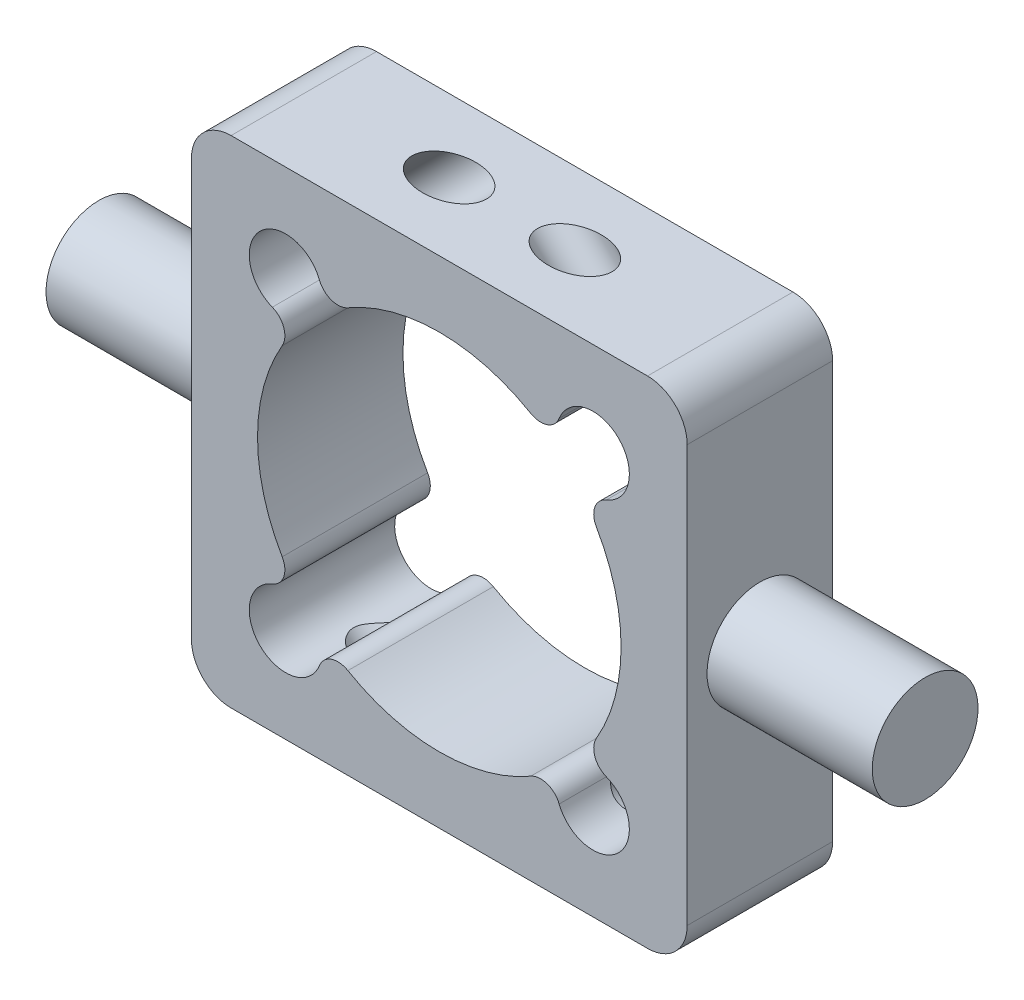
from build123d import *

# Parameters (mm, degrees)
ESBO_O1_W                 = 75
ESBO_O1_H                 = 75
EXTRUS_O1_DEPTH           = 22
ESBO_O2_R                 = 8
EXTRUS_O2_DEPTH           = 25
FILETE2_R                 = 6
ESBO_O6_R                 = 4
EXTRUS_O5_DEPTH           = 25
ESPELHAR3_COPY_1_SKETCH_R = 4
ESPELHAR3_COPY_1_DEPTH    = 25


with BuildPart() as part:
    # Esbo_o1 → Extrus_o1 (new body)
    with BuildSketch(Plane.XY):
        Rectangle(ESBO_O1_W, ESBO_O1_H)
        with BuildLine():
            ThreePointArc((-23.768657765, 13.831157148), (-27.5, 0), (-23.768657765, -13.831157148))
            ThreePointArc((-23.768657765, -13.831157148), (-23.527880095, -16.324905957), (-25.26338969, -18.1317716))
            ThreePointArc((-25.26338969, -18.1317716), (-27.139087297, -27.139087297), (-18.1317716, -25.26338969))
            ThreePointArc((-18.1317716, -25.26338969), (-16.324905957, -23.527880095), (-13.831157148, -23.768657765))
            ThreePointArc((-13.831157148, -23.768657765), (0, -27.5), (13.831157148, -23.768657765))
            ThreePointArc((13.831157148, -23.768657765), (16.324905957, -23.527880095), (18.1317716, -25.26338969))
            ThreePointArc((18.1317716, -25.26338969), (27.139087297, -27.139087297), (25.26338969, -18.1317716))
            ThreePointArc((25.26338969, -18.1317716), (23.527880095, -16.324905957), (23.768657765, -13.831157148))
            ThreePointArc((23.768657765, -13.831157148), (27.5, 0), (23.768657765, 13.831157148))
            ThreePointArc((23.768657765, 13.831157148), (23.527880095, 16.324905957), (25.26338969, 18.1317716))
            ThreePointArc((25.26338969, 18.1317716), (27.139087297, 27.139087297), (18.1317716, 25.26338969))
            ThreePointArc((18.1317716, 25.26338969), (16.324905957, 23.527880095), (13.831157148, 23.768657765))
            ThreePointArc((13.831157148, 23.768657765), (0, 27.5), (-13.831157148, 23.768657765))
            ThreePointArc((-13.831157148, 23.768657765), (-16.324905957, 23.527880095), (-18.1317716, 25.26338969))
            ThreePointArc((-18.1317716, 25.26338969), (-27.139087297, 27.139087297), (-25.26338969, 18.1317716))
            ThreePointArc((-25.26338969, 18.1317716), (-23.527880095, 16.324905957), (-23.768657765, 13.831157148))
        make_face(mode=Mode.SUBTRACT)
    extrude(amount=EXTRUS_O1_DEPTH)

    # Esbo_o2 → Extrus_o2 (add)
    with BuildSketch(Plane.ZY.offset(37.5)):
        with Locations(Location((11, 0, 0), (0, 0, 90))):
            Circle(ESBO_O2_R)
    extrus_o2 = extrude(amount=EXTRUS_O2_DEPTH)

    # Espelhar1: Extrus_o2 across plane
    add(extrus_o2.mirror(Plane(origin=(0, 0, 0), x_dir=(0, 0, 1), z_dir=(1, 0, 0))))

    # Filete2
    filete2_edges = [part.edges().sort_by_distance(p)[0] for p in [
        (-37.5, 37.5, 11),
        (37.5, 37.5, 11),
        (37.5, -37.5, 11),
        (-37.5, -37.5, 11),
    ]]
    fillet(filete2_edges, radius=FILETE2_R)

    # Esbo_o6 → Extrus_o5 (cut)
    with BuildSketch(Plane(origin=(-17.64739439, 17.64739439, 0), x_dir=(0.7071067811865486, 0.7071067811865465, 0), z_dir=(0.7071067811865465, -0.7071067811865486, 0))):
        with Locations(Location((33.242640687, 11, 0), (0, 0, 180))):
            Circle(ESBO_O6_R)
    extrus_o5 = extrude(amount=EXTRUS_O5_DEPTH, mode=Mode.SUBTRACT)

    # Espelhar2: Extrus_o5 across plane
    add(extrus_o5.mirror(Plane(origin=(0, 0, 0), x_dir=(0, 0, 1), z_dir=(1, 0, 0))), mode=Mode.SUBTRACT)

    # Espelhar3: Extrus_o5 across plane
    add(extrus_o5.mirror(Plane.ZX), mode=Mode.SUBTRACT)

    # Espelhar3 copy 1 sketch → Espelhar3 copy 1 (cut)
    with BuildSketch(Plane(origin=(17.64739439, -17.64739439, 0), x_dir=(-0.707106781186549, -0.707106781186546, 0), z_dir=(-0.707106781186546, 0.707106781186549, 0))):
        with Locations(Location((33.242640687, 11, 0), (0, 0, 180))):
            Circle(ESPELHAR3_COPY_1_SKETCH_R)
    extrude(amount=ESPELHAR3_COPY_1_DEPTH, mode=Mode.SUBTRACT)


solid = part.part
